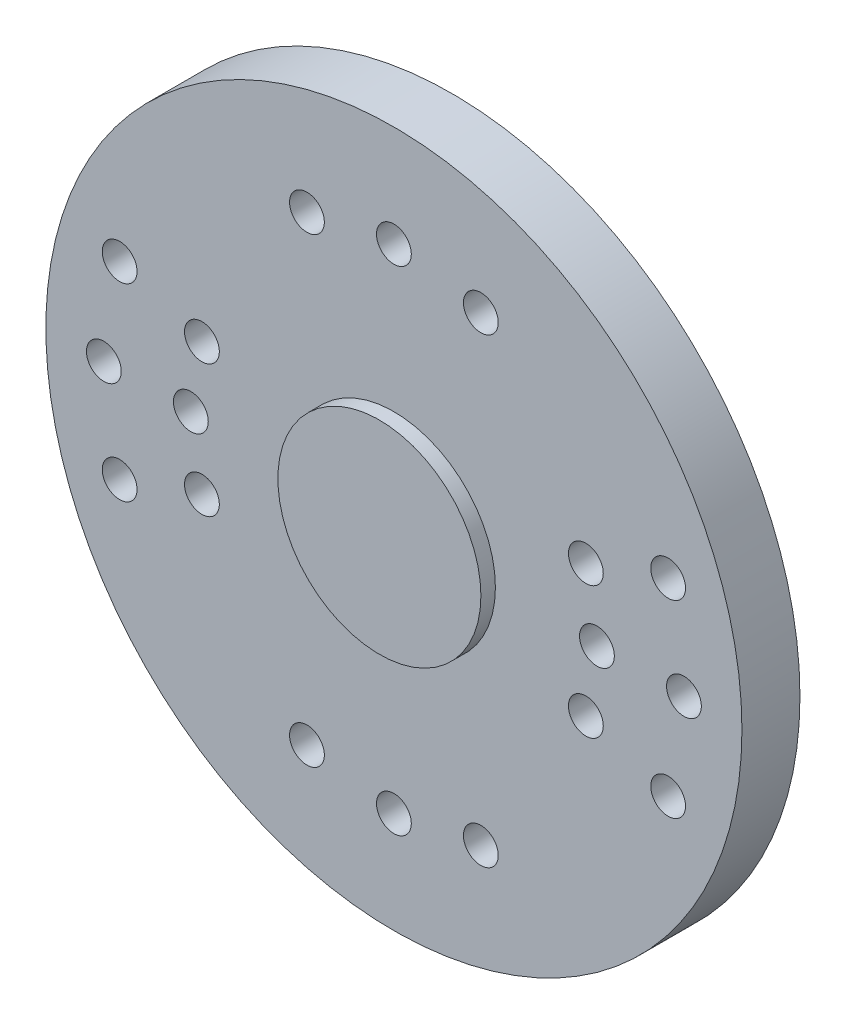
ISO-10303-21;
HEADER;
FILE_DESCRIPTION(('STEP AP214'),'2;1');
FILE_NAME('part.step','',(''),(''),'','','');
FILE_SCHEMA(('AUTOMOTIVE_DESIGN { 1 0 10303 214 1 1 1 1 }'));
ENDSEC;
DATA;
#1=APPLICATION_CONTEXT('core data for automotive mechanical design processes');
#2=APPLICATION_PROTOCOL_DEFINITION('international standard','automotive_design',2000,#1);
#3=PRODUCT_CONTEXT('',#1,'mechanical');
#4=PRODUCT('Part','Part','',(#3));
#5=PRODUCT_RELATED_PRODUCT_CATEGORY('part','',(#4));
#6=PRODUCT_DEFINITION_FORMATION('','',#4);
#7=PRODUCT_DEFINITION_CONTEXT('part definition',#1,'design');
#8=PRODUCT_DEFINITION('design','',#6,#7);
#9=PRODUCT_DEFINITION_SHAPE('','',#8);
#10=(LENGTH_UNIT() NAMED_UNIT(*) SI_UNIT(.MILLI.,.METRE.));
#11=(NAMED_UNIT(*) PLANE_ANGLE_UNIT() SI_UNIT($,.RADIAN.));
#12=(NAMED_UNIT(*) SI_UNIT($,.STERADIAN.) SOLID_ANGLE_UNIT());
#13=UNCERTAINTY_MEASURE_WITH_UNIT(LENGTH_MEASURE(1.E-05),#10,'distance_accuracy_value','');
#14=(GEOMETRIC_REPRESENTATION_CONTEXT(3) GLOBAL_UNCERTAINTY_ASSIGNED_CONTEXT((#13)) GLOBAL_UNIT_ASSIGNED_CONTEXT((#10,
#11,#12)) REPRESENTATION_CONTEXT('',''));
#15=CARTESIAN_POINT('',(0.,0.,0.));
#16=DIRECTION('',(0.,0.,1.));
#17=DIRECTION('',(1.,0.,0.));
#18=AXIS2_PLACEMENT_3D('',#15,#16,#17);
#19=CARTESIAN_POINT('',(0.,0.,0.));
#20=DIRECTION('',(0.,0.,1.));
#21=DIRECTION('',(1.,0.,0.));
#22=AXIS2_PLACEMENT_3D('',#19,#20,#21);
#23=PLANE('',#22);
#24=CARTESIAN_POINT('',(9.45518575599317,3.25568154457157,0.));
#25=DIRECTION('',(0.,0.,1.));
#26=DIRECTION('',(1.,0.,0.));
#27=AXIS2_PLACEMENT_3D('',#24,#25,#26);
#28=CIRCLE('',#27,0.6);
#29=CARTESIAN_POINT('',(10.0551857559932,3.25568154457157,0.));
#30=VERTEX_POINT('',#29);
#31=EDGE_CURVE('E160',#30,#30,#28,.T.);
#32=ORIENTED_EDGE('',*,*,#31,.T.);
#33=EDGE_LOOP('',(#32));
#34=FACE_BOUND('',#33,.T.);
#35=CARTESIAN_POINT('',(10.,0.,0.));
#36=DIRECTION('',(0.,0.,1.));
#37=DIRECTION('',(1.,0.,0.));
#38=AXIS2_PLACEMENT_3D('',#35,#36,#37);
#39=CIRCLE('',#38,0.6);
#40=CARTESIAN_POINT('',(10.6,0.,0.));
#41=VERTEX_POINT('',#40);
#42=EDGE_CURVE('E154',#41,#41,#39,.T.);
#43=ORIENTED_EDGE('',*,*,#42,.T.);
#44=EDGE_LOOP('',(#43));
#45=FACE_BOUND('',#44,.T.);
#46=CARTESIAN_POINT('',(9.45518575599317,-3.25568154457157,0.));
#47=DIRECTION('',(0.,0.,1.));
#48=DIRECTION('',(1.,0.,0.));
#49=AXIS2_PLACEMENT_3D('',#46,#47,#48);
#50=CIRCLE('',#49,0.6);
#51=CARTESIAN_POINT('',(10.0551857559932,-3.25568154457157,0.));
#52=VERTEX_POINT('',#51);
#53=EDGE_CURVE('E148',#52,#52,#50,.T.);
#54=ORIENTED_EDGE('',*,*,#53,.T.);
#55=EDGE_LOOP('',(#54));
#56=FACE_BOUND('',#55,.T.);
#57=CARTESIAN_POINT('',(6.61863002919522,-2.2789770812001,0.));
#58=DIRECTION('',(0.,0.,1.));
#59=DIRECTION('',(1.,0.,0.));
#60=AXIS2_PLACEMENT_3D('',#57,#58,#59);
#61=CIRCLE('',#60,0.6);
#62=CARTESIAN_POINT('',(7.21863002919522,-2.2789770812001,0.));
#63=VERTEX_POINT('',#62);
#64=EDGE_CURVE('E142',#63,#63,#61,.T.);
#65=ORIENTED_EDGE('',*,*,#64,.T.);
#66=EDGE_LOOP('',(#65));
#67=FACE_BOUND('',#66,.T.);
#68=CARTESIAN_POINT('',(7.,0.,0.));
#69=DIRECTION('',(0.,0.,1.));
#70=DIRECTION('',(1.,0.,0.));
#71=AXIS2_PLACEMENT_3D('',#68,#69,#70);
#72=CIRCLE('',#71,0.6);
#73=CARTESIAN_POINT('',(7.6,0.,0.));
#74=VERTEX_POINT('',#73);
#75=EDGE_CURVE('E136',#74,#74,#72,.T.);
#76=ORIENTED_EDGE('',*,*,#75,.T.);
#77=EDGE_LOOP('',(#76));
#78=FACE_BOUND('',#77,.T.);
#79=CARTESIAN_POINT('',(6.61863002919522,2.2789770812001,0.));
#80=DIRECTION('',(0.,0.,1.));
#81=DIRECTION('',(1.,0.,0.));
#82=AXIS2_PLACEMENT_3D('',#79,#80,#81);
#83=CIRCLE('',#82,0.6);
#84=CARTESIAN_POINT('',(7.21863002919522,2.2789770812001,0.));
#85=VERTEX_POINT('',#84);
#86=EDGE_CURVE('E130',#85,#85,#83,.T.);
#87=ORIENTED_EDGE('',*,*,#86,.T.);
#88=EDGE_LOOP('',(#87));
#89=FACE_BOUND('',#88,.T.);
#90=CARTESIAN_POINT('',(-9.45518575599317,3.25568154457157,0.));
#91=DIRECTION('',(0.,0.,1.));
#92=DIRECTION('',(1.,0.,0.));
#93=AXIS2_PLACEMENT_3D('',#90,#91,#92);
#94=CIRCLE('',#93,0.6);
#95=CARTESIAN_POINT('',(-8.85518575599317,3.25568154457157,0.));
#96=VERTEX_POINT('',#95);
#97=EDGE_CURVE('E124',#96,#96,#94,.T.);
#98=ORIENTED_EDGE('',*,*,#97,.T.);
#99=EDGE_LOOP('',(#98));
#100=FACE_BOUND('',#99,.T.);
#101=CARTESIAN_POINT('',(-10.,0.,0.));
#102=DIRECTION('',(0.,0.,1.));
#103=DIRECTION('',(1.,0.,0.));
#104=AXIS2_PLACEMENT_3D('',#101,#102,#103);
#105=CIRCLE('',#104,0.6);
#106=CARTESIAN_POINT('',(-9.4,0.,0.));
#107=VERTEX_POINT('',#106);
#108=EDGE_CURVE('E118',#107,#107,#105,.T.);
#109=ORIENTED_EDGE('',*,*,#108,.T.);
#110=EDGE_LOOP('',(#109));
#111=FACE_BOUND('',#110,.T.);
#112=CARTESIAN_POINT('',(-9.45518575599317,-3.25568154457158,0.));
#113=DIRECTION('',(0.,0.,1.));
#114=DIRECTION('',(1.,0.,0.));
#115=AXIS2_PLACEMENT_3D('',#112,#113,#114);
#116=CIRCLE('',#115,0.6);
#117=CARTESIAN_POINT('',(-8.85518575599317,-3.25568154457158,0.));
#118=VERTEX_POINT('',#117);
#119=EDGE_CURVE('E112',#118,#118,#116,.T.);
#120=ORIENTED_EDGE('',*,*,#119,.T.);
#121=EDGE_LOOP('',(#120));
#122=FACE_BOUND('',#121,.T.);
#123=CARTESIAN_POINT('',(-6.61863002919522,-2.2789770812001,0.));
#124=DIRECTION('',(0.,0.,1.));
#125=DIRECTION('',(1.,0.,0.));
#126=AXIS2_PLACEMENT_3D('',#123,#124,#125);
#127=CIRCLE('',#126,0.6);
#128=CARTESIAN_POINT('',(-6.01863002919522,-2.2789770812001,0.));
#129=VERTEX_POINT('',#128);
#130=EDGE_CURVE('E106',#129,#129,#127,.T.);
#131=ORIENTED_EDGE('',*,*,#130,.T.);
#132=EDGE_LOOP('',(#131));
#133=FACE_BOUND('',#132,.T.);
#134=CARTESIAN_POINT('',(-7.,0.,0.));
#135=DIRECTION('',(0.,0.,1.));
#136=DIRECTION('',(1.,0.,0.));
#137=AXIS2_PLACEMENT_3D('',#134,#135,#136);
#138=CIRCLE('',#137,0.6);
#139=CARTESIAN_POINT('',(-6.4,0.,0.));
#140=VERTEX_POINT('',#139);
#141=EDGE_CURVE('E100',#140,#140,#138,.T.);
#142=ORIENTED_EDGE('',*,*,#141,.T.);
#143=EDGE_LOOP('',(#142));
#144=FACE_BOUND('',#143,.T.);
#145=CARTESIAN_POINT('',(-6.61863002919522,2.2789770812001,0.));
#146=DIRECTION('',(0.,0.,1.));
#147=DIRECTION('',(1.,0.,0.));
#148=AXIS2_PLACEMENT_3D('',#145,#146,#147);
#149=CIRCLE('',#148,0.6);
#150=CARTESIAN_POINT('',(-6.01863002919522,2.2789770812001,0.));
#151=VERTEX_POINT('',#150);
#152=EDGE_CURVE('E94',#151,#151,#149,.T.);
#153=ORIENTED_EDGE('',*,*,#152,.T.);
#154=EDGE_LOOP('',(#153));
#155=FACE_BOUND('',#154,.T.);
#156=CARTESIAN_POINT('',(2.9975962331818,-7.95389318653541,0.));
#157=DIRECTION('',(0.,0.,1.));
#158=DIRECTION('',(1.,0.,0.));
#159=AXIS2_PLACEMENT_3D('',#156,#157,#158);
#160=CIRCLE('',#159,0.6);
#161=CARTESIAN_POINT('',(3.5975962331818,-7.95389318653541,0.));
#162=VERTEX_POINT('',#161);
#163=EDGE_CURVE('E88',#162,#162,#160,.T.);
#164=ORIENTED_EDGE('',*,*,#163,.T.);
#165=EDGE_LOOP('',(#164));
#166=FACE_BOUND('',#165,.T.);
#167=CARTESIAN_POINT('',(0.,-8.5,0.));
#168=DIRECTION('',(0.,0.,1.));
#169=DIRECTION('',(1.,0.,0.));
#170=AXIS2_PLACEMENT_3D('',#167,#168,#169);
#171=CIRCLE('',#170,0.6);
#172=CARTESIAN_POINT('',(0.600000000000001,-8.5,0.));
#173=VERTEX_POINT('',#172);
#174=EDGE_CURVE('E82',#173,#173,#171,.T.);
#175=ORIENTED_EDGE('',*,*,#174,.T.);
#176=EDGE_LOOP('',(#175));
#177=FACE_BOUND('',#176,.T.);
#178=CARTESIAN_POINT('',(-2.9975962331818,-7.95389318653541,0.));
#179=DIRECTION('',(0.,0.,1.));
#180=DIRECTION('',(1.,0.,0.));
#181=AXIS2_PLACEMENT_3D('',#178,#179,#180);
#182=CIRCLE('',#181,0.6);
#183=CARTESIAN_POINT('',(-2.3975962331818,-7.95389318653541,0.));
#184=VERTEX_POINT('',#183);
#185=EDGE_CURVE('E76',#184,#184,#182,.T.);
#186=ORIENTED_EDGE('',*,*,#185,.T.);
#187=EDGE_LOOP('',(#186));
#188=FACE_BOUND('',#187,.T.);
#189=CARTESIAN_POINT('',(2.9975962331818,7.95389318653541,0.));
#190=DIRECTION('',(0.,0.,1.));
#191=DIRECTION('',(1.,0.,0.));
#192=AXIS2_PLACEMENT_3D('',#189,#190,#191);
#193=CIRCLE('',#192,0.6);
#194=CARTESIAN_POINT('',(3.5975962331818,7.95389318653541,0.));
#195=VERTEX_POINT('',#194);
#196=EDGE_CURVE('E70',#195,#195,#193,.T.);
#197=ORIENTED_EDGE('',*,*,#196,.T.);
#198=EDGE_LOOP('',(#197));
#199=FACE_BOUND('',#198,.T.);
#200=CARTESIAN_POINT('',(0.,8.5,0.));
#201=DIRECTION('',(0.,0.,1.));
#202=DIRECTION('',(1.,0.,0.));
#203=AXIS2_PLACEMENT_3D('',#200,#201,#202);
#204=CIRCLE('',#203,0.6);
#205=CARTESIAN_POINT('',(0.600000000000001,8.5,0.));
#206=VERTEX_POINT('',#205);
#207=EDGE_CURVE('E64',#206,#206,#204,.T.);
#208=ORIENTED_EDGE('',*,*,#207,.T.);
#209=EDGE_LOOP('',(#208));
#210=FACE_BOUND('',#209,.T.);
#211=CARTESIAN_POINT('',(-2.9975962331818,7.9538931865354,0.));
#212=DIRECTION('',(0.,0.,1.));
#213=DIRECTION('',(1.,0.,0.));
#214=AXIS2_PLACEMENT_3D('',#211,#212,#213);
#215=CIRCLE('',#214,0.6);
#216=CARTESIAN_POINT('',(-2.3975962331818,7.9538931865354,0.));
#217=VERTEX_POINT('',#216);
#218=EDGE_CURVE('E58',#217,#217,#215,.T.);
#219=ORIENTED_EDGE('',*,*,#218,.T.);
#220=EDGE_LOOP('',(#219));
#221=FACE_BOUND('',#220,.T.);
#222=CARTESIAN_POINT('',(0.,0.,0.));
#223=DIRECTION('',(0.,0.,1.));
#224=DIRECTION('',(1.,0.,0.));
#225=AXIS2_PLACEMENT_3D('',#222,#223,#224);
#226=CIRCLE('',#225,12.);
#227=CARTESIAN_POINT('',(12.,0.,0.));
#228=VERTEX_POINT('',#227);
#229=EDGE_CURVE('E43',#228,#228,#226,.T.);
#230=ORIENTED_EDGE('',*,*,#229,.F.);
#231=EDGE_LOOP('',(#230));
#232=FACE_BOUND('',#231,.T.);
#233=CARTESIAN_POINT('',(0.,0.,0.));
#234=DIRECTION('',(0.,0.,1.));
#235=DIRECTION('',(1.,0.,0.));
#236=AXIS2_PLACEMENT_3D('',#233,#234,#235);
#237=CIRCLE('',#236,4.5);
#238=CARTESIAN_POINT('',(4.5,0.,0.));
#239=VERTEX_POINT('',#238);
#240=EDGE_CURVE('E10',#239,#239,#237,.F.);
#241=ORIENTED_EDGE('',*,*,#240,.F.);
#242=EDGE_LOOP('',(#241));
#243=FACE_BOUND('',#242,.T.);
#244=ADVANCED_FACE('F32',(#34,#45,#56,#67,#78,#89,#100,#111,#122,#133,#144,#155,#166,#177,#188,
#199,#210,#221,#232,#243),#23,.F.);
#245=CARTESIAN_POINT('',(0.,0.,2.));
#246=DIRECTION('',(0.,0.,1.));
#247=DIRECTION('',(1.,0.,0.));
#248=AXIS2_PLACEMENT_3D('',#245,#246,#247);
#249=PLANE('',#248);
#250=CARTESIAN_POINT('',(9.45518575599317,3.25568154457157,2.));
#251=DIRECTION('',(0.,0.,1.));
#252=DIRECTION('',(1.,0.,0.));
#253=AXIS2_PLACEMENT_3D('',#250,#251,#252);
#254=CIRCLE('',#253,0.6);
#255=CARTESIAN_POINT('',(10.0551857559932,3.25568154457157,2.));
#256=VERTEX_POINT('',#255);
#257=EDGE_CURVE('E163',#256,#256,#254,.T.);
#258=ORIENTED_EDGE('',*,*,#257,.F.);
#259=EDGE_LOOP('',(#258));
#260=FACE_BOUND('',#259,.T.);
#261=CARTESIAN_POINT('',(10.,0.,2.));
#262=DIRECTION('',(0.,0.,1.));
#263=DIRECTION('',(1.,0.,0.));
#264=AXIS2_PLACEMENT_3D('',#261,#262,#263);
#265=CIRCLE('',#264,0.6);
#266=CARTESIAN_POINT('',(10.6,0.,2.));
#267=VERTEX_POINT('',#266);
#268=EDGE_CURVE('E157',#267,#267,#265,.T.);
#269=ORIENTED_EDGE('',*,*,#268,.F.);
#270=EDGE_LOOP('',(#269));
#271=FACE_BOUND('',#270,.T.);
#272=CARTESIAN_POINT('',(9.45518575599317,-3.25568154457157,2.));
#273=DIRECTION('',(0.,0.,1.));
#274=DIRECTION('',(1.,0.,0.));
#275=AXIS2_PLACEMENT_3D('',#272,#273,#274);
#276=CIRCLE('',#275,0.6);
#277=CARTESIAN_POINT('',(10.0551857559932,-3.25568154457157,2.));
#278=VERTEX_POINT('',#277);
#279=EDGE_CURVE('E151',#278,#278,#276,.T.);
#280=ORIENTED_EDGE('',*,*,#279,.F.);
#281=EDGE_LOOP('',(#280));
#282=FACE_BOUND('',#281,.T.);
#283=CARTESIAN_POINT('',(6.61863002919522,-2.2789770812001,2.));
#284=DIRECTION('',(0.,0.,1.));
#285=DIRECTION('',(1.,0.,0.));
#286=AXIS2_PLACEMENT_3D('',#283,#284,#285);
#287=CIRCLE('',#286,0.6);
#288=CARTESIAN_POINT('',(7.21863002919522,-2.2789770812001,2.));
#289=VERTEX_POINT('',#288);
#290=EDGE_CURVE('E145',#289,#289,#287,.T.);
#291=ORIENTED_EDGE('',*,*,#290,.F.);
#292=EDGE_LOOP('',(#291));
#293=FACE_BOUND('',#292,.T.);
#294=CARTESIAN_POINT('',(7.,0.,2.));
#295=DIRECTION('',(0.,0.,1.));
#296=DIRECTION('',(1.,0.,0.));
#297=AXIS2_PLACEMENT_3D('',#294,#295,#296);
#298=CIRCLE('',#297,0.6);
#299=CARTESIAN_POINT('',(7.6,0.,2.));
#300=VERTEX_POINT('',#299);
#301=EDGE_CURVE('E139',#300,#300,#298,.T.);
#302=ORIENTED_EDGE('',*,*,#301,.F.);
#303=EDGE_LOOP('',(#302));
#304=FACE_BOUND('',#303,.T.);
#305=CARTESIAN_POINT('',(6.61863002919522,2.2789770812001,2.));
#306=DIRECTION('',(0.,0.,1.));
#307=DIRECTION('',(1.,0.,0.));
#308=AXIS2_PLACEMENT_3D('',#305,#306,#307);
#309=CIRCLE('',#308,0.6);
#310=CARTESIAN_POINT('',(7.21863002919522,2.2789770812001,2.));
#311=VERTEX_POINT('',#310);
#312=EDGE_CURVE('E133',#311,#311,#309,.T.);
#313=ORIENTED_EDGE('',*,*,#312,.F.);
#314=EDGE_LOOP('',(#313));
#315=FACE_BOUND('',#314,.T.);
#316=CARTESIAN_POINT('',(-9.45518575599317,3.25568154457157,2.));
#317=DIRECTION('',(0.,0.,1.));
#318=DIRECTION('',(1.,0.,0.));
#319=AXIS2_PLACEMENT_3D('',#316,#317,#318);
#320=CIRCLE('',#319,0.6);
#321=CARTESIAN_POINT('',(-8.85518575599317,3.25568154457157,2.));
#322=VERTEX_POINT('',#321);
#323=EDGE_CURVE('E127',#322,#322,#320,.T.);
#324=ORIENTED_EDGE('',*,*,#323,.F.);
#325=EDGE_LOOP('',(#324));
#326=FACE_BOUND('',#325,.T.);
#327=CARTESIAN_POINT('',(-10.,0.,2.));
#328=DIRECTION('',(0.,0.,1.));
#329=DIRECTION('',(1.,0.,0.));
#330=AXIS2_PLACEMENT_3D('',#327,#328,#329);
#331=CIRCLE('',#330,0.6);
#332=CARTESIAN_POINT('',(-9.4,0.,2.));
#333=VERTEX_POINT('',#332);
#334=EDGE_CURVE('E121',#333,#333,#331,.T.);
#335=ORIENTED_EDGE('',*,*,#334,.F.);
#336=EDGE_LOOP('',(#335));
#337=FACE_BOUND('',#336,.T.);
#338=CARTESIAN_POINT('',(-9.45518575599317,-3.25568154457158,2.));
#339=DIRECTION('',(0.,0.,1.));
#340=DIRECTION('',(1.,0.,0.));
#341=AXIS2_PLACEMENT_3D('',#338,#339,#340);
#342=CIRCLE('',#341,0.6);
#343=CARTESIAN_POINT('',(-8.85518575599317,-3.25568154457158,2.));
#344=VERTEX_POINT('',#343);
#345=EDGE_CURVE('E115',#344,#344,#342,.T.);
#346=ORIENTED_EDGE('',*,*,#345,.F.);
#347=EDGE_LOOP('',(#346));
#348=FACE_BOUND('',#347,.T.);
#349=CARTESIAN_POINT('',(-6.61863002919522,-2.2789770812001,2.));
#350=DIRECTION('',(0.,0.,1.));
#351=DIRECTION('',(1.,0.,0.));
#352=AXIS2_PLACEMENT_3D('',#349,#350,#351);
#353=CIRCLE('',#352,0.6);
#354=CARTESIAN_POINT('',(-6.01863002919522,-2.2789770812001,2.));
#355=VERTEX_POINT('',#354);
#356=EDGE_CURVE('E109',#355,#355,#353,.T.);
#357=ORIENTED_EDGE('',*,*,#356,.F.);
#358=EDGE_LOOP('',(#357));
#359=FACE_BOUND('',#358,.T.);
#360=CARTESIAN_POINT('',(-7.,0.,2.));
#361=DIRECTION('',(0.,0.,1.));
#362=DIRECTION('',(1.,0.,0.));
#363=AXIS2_PLACEMENT_3D('',#360,#361,#362);
#364=CIRCLE('',#363,0.6);
#365=CARTESIAN_POINT('',(-6.4,0.,2.));
#366=VERTEX_POINT('',#365);
#367=EDGE_CURVE('E103',#366,#366,#364,.T.);
#368=ORIENTED_EDGE('',*,*,#367,.F.);
#369=EDGE_LOOP('',(#368));
#370=FACE_BOUND('',#369,.T.);
#371=CARTESIAN_POINT('',(-6.61863002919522,2.2789770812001,2.));
#372=DIRECTION('',(0.,0.,1.));
#373=DIRECTION('',(1.,0.,0.));
#374=AXIS2_PLACEMENT_3D('',#371,#372,#373);
#375=CIRCLE('',#374,0.6);
#376=CARTESIAN_POINT('',(-6.01863002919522,2.2789770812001,2.));
#377=VERTEX_POINT('',#376);
#378=EDGE_CURVE('E97',#377,#377,#375,.T.);
#379=ORIENTED_EDGE('',*,*,#378,.F.);
#380=EDGE_LOOP('',(#379));
#381=FACE_BOUND('',#380,.T.);
#382=CARTESIAN_POINT('',(2.9975962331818,-7.95389318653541,2.));
#383=DIRECTION('',(0.,0.,1.));
#384=DIRECTION('',(1.,0.,0.));
#385=AXIS2_PLACEMENT_3D('',#382,#383,#384);
#386=CIRCLE('',#385,0.6);
#387=CARTESIAN_POINT('',(3.5975962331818,-7.95389318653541,2.));
#388=VERTEX_POINT('',#387);
#389=EDGE_CURVE('E91',#388,#388,#386,.T.);
#390=ORIENTED_EDGE('',*,*,#389,.F.);
#391=EDGE_LOOP('',(#390));
#392=FACE_BOUND('',#391,.T.);
#393=CARTESIAN_POINT('',(0.,-8.5,2.));
#394=DIRECTION('',(0.,0.,1.));
#395=DIRECTION('',(1.,0.,0.));
#396=AXIS2_PLACEMENT_3D('',#393,#394,#395);
#397=CIRCLE('',#396,0.6);
#398=CARTESIAN_POINT('',(0.600000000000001,-8.5,2.));
#399=VERTEX_POINT('',#398);
#400=EDGE_CURVE('E85',#399,#399,#397,.T.);
#401=ORIENTED_EDGE('',*,*,#400,.F.);
#402=EDGE_LOOP('',(#401));
#403=FACE_BOUND('',#402,.T.);
#404=CARTESIAN_POINT('',(-2.9975962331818,-7.95389318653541,2.));
#405=DIRECTION('',(0.,0.,1.));
#406=DIRECTION('',(1.,0.,0.));
#407=AXIS2_PLACEMENT_3D('',#404,#405,#406);
#408=CIRCLE('',#407,0.6);
#409=CARTESIAN_POINT('',(-2.3975962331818,-7.95389318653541,2.));
#410=VERTEX_POINT('',#409);
#411=EDGE_CURVE('E79',#410,#410,#408,.T.);
#412=ORIENTED_EDGE('',*,*,#411,.F.);
#413=EDGE_LOOP('',(#412));
#414=FACE_BOUND('',#413,.T.);
#415=CARTESIAN_POINT('',(2.9975962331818,7.95389318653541,2.));
#416=DIRECTION('',(0.,0.,1.));
#417=DIRECTION('',(1.,0.,0.));
#418=AXIS2_PLACEMENT_3D('',#415,#416,#417);
#419=CIRCLE('',#418,0.6);
#420=CARTESIAN_POINT('',(3.5975962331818,7.95389318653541,2.));
#421=VERTEX_POINT('',#420);
#422=EDGE_CURVE('E73',#421,#421,#419,.T.);
#423=ORIENTED_EDGE('',*,*,#422,.F.);
#424=EDGE_LOOP('',(#423));
#425=FACE_BOUND('',#424,.T.);
#426=CARTESIAN_POINT('',(0.,8.5,2.));
#427=DIRECTION('',(0.,0.,1.));
#428=DIRECTION('',(1.,0.,0.));
#429=AXIS2_PLACEMENT_3D('',#426,#427,#428);
#430=CIRCLE('',#429,0.6);
#431=CARTESIAN_POINT('',(0.600000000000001,8.5,2.));
#432=VERTEX_POINT('',#431);
#433=EDGE_CURVE('E67',#432,#432,#430,.T.);
#434=ORIENTED_EDGE('',*,*,#433,.F.);
#435=EDGE_LOOP('',(#434));
#436=FACE_BOUND('',#435,.T.);
#437=CARTESIAN_POINT('',(-2.9975962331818,7.9538931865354,2.));
#438=DIRECTION('',(0.,0.,1.));
#439=DIRECTION('',(1.,0.,0.));
#440=AXIS2_PLACEMENT_3D('',#437,#438,#439);
#441=CIRCLE('',#440,0.6);
#442=CARTESIAN_POINT('',(-2.3975962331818,7.9538931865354,2.));
#443=VERTEX_POINT('',#442);
#444=EDGE_CURVE('E61',#443,#443,#441,.T.);
#445=ORIENTED_EDGE('',*,*,#444,.F.);
#446=EDGE_LOOP('',(#445));
#447=FACE_BOUND('',#446,.T.);
#448=CARTESIAN_POINT('',(0.,0.,2.));
#449=DIRECTION('',(0.,0.,1.));
#450=DIRECTION('',(1.,0.,0.));
#451=AXIS2_PLACEMENT_3D('',#448,#449,#450);
#452=CIRCLE('',#451,12.);
#453=CARTESIAN_POINT('',(12.,0.,2.));
#454=VERTEX_POINT('',#453);
#455=EDGE_CURVE('E39',#454,#454,#452,.T.);
#456=ORIENTED_EDGE('',*,*,#455,.T.);
#457=EDGE_LOOP('',(#456));
#458=FACE_BOUND('',#457,.T.);
#459=CARTESIAN_POINT('',(0.,0.,2.));
#460=DIRECTION('',(0.,0.,1.));
#461=DIRECTION('',(1.,0.,0.));
#462=AXIS2_PLACEMENT_3D('',#459,#460,#461);
#463=CIRCLE('',#462,3.5);
#464=CARTESIAN_POINT('',(3.5,0.,2.));
#465=VERTEX_POINT('',#464);
#466=EDGE_CURVE('E50',#465,#465,#463,.T.);
#467=ORIENTED_EDGE('',*,*,#466,.F.);
#468=EDGE_LOOP('',(#467));
#469=FACE_BOUND('',#468,.T.);
#470=ADVANCED_FACE('F200',(#260,#271,#282,#293,#304,#315,#326,#337,#348,#359,#370,#381,#392,
#403,#414,#425,#436,#447,#458,#469),#249,.T.);
#471=CARTESIAN_POINT('',(0.,0.,2.));
#472=DIRECTION('',(0.,0.,-1.));
#473=DIRECTION('',(-1.,0.,0.));
#474=AXIS2_PLACEMENT_3D('',#471,#472,#473);
#475=CYLINDRICAL_SURFACE('',#474,12.);
#476=ORIENTED_EDGE('',*,*,#455,.F.);
#477=EDGE_LOOP('',(#476));
#478=FACE_BOUND('',#477,.T.);
#479=ORIENTED_EDGE('',*,*,#229,.T.);
#480=EDGE_LOOP('',(#479));
#481=FACE_BOUND('',#480,.T.);
#482=ADVANCED_FACE('F34',(#478,#481),#475,.T.);
#483=CARTESIAN_POINT('',(0.,0.,2.5));
#484=DIRECTION('',(0.,0.,-1.));
#485=DIRECTION('',(-1.,0.,0.));
#486=AXIS2_PLACEMENT_3D('',#483,#484,#485);
#487=CYLINDRICAL_SURFACE('',#486,3.5);
#488=CARTESIAN_POINT('',(0.,0.,2.5));
#489=DIRECTION('',(0.,0.,1.));
#490=DIRECTION('',(1.,0.,0.));
#491=AXIS2_PLACEMENT_3D('',#488,#489,#490);
#492=CIRCLE('',#491,3.5);
#493=CARTESIAN_POINT('',(3.5,0.,2.5));
#494=VERTEX_POINT('',#493);
#495=EDGE_CURVE('E48',#494,#494,#492,.T.);
#496=ORIENTED_EDGE('',*,*,#495,.F.);
#497=EDGE_LOOP('',(#496));
#498=FACE_BOUND('',#497,.T.);
#499=ORIENTED_EDGE('',*,*,#466,.T.);
#500=EDGE_LOOP('',(#499));
#501=FACE_BOUND('',#500,.T.);
#502=ADVANCED_FACE('F196',(#498,#501),#487,.T.);
#503=CARTESIAN_POINT('',(0.,0.,2.5));
#504=DIRECTION('',(0.,0.,1.));
#505=DIRECTION('',(1.,0.,0.));
#506=AXIS2_PLACEMENT_3D('',#503,#504,#505);
#507=PLANE('',#506);
#508=ORIENTED_EDGE('',*,*,#495,.T.);
#509=EDGE_LOOP('',(#508));
#510=FACE_BOUND('',#509,.T.);
#511=ADVANCED_FACE('F191',(#510),#507,.T.);
#512=CARTESIAN_POINT('',(0.,0.,-2.));
#513=DIRECTION('',(0.,0.,1.));
#514=DIRECTION('',(1.,0.,0.));
#515=AXIS2_PLACEMENT_3D('',#512,#513,#514);
#516=CYLINDRICAL_SURFACE('',#515,4.5);
#517=CARTESIAN_POINT('',(0.,0.,-2.));
#518=DIRECTION('',(0.,0.,-1.));
#519=DIRECTION('',(-1.,0.,0.));
#520=AXIS2_PLACEMENT_3D('',#517,#518,#519);
#521=CIRCLE('',#520,4.5);
#522=CARTESIAN_POINT('',(-4.5,0.,-2.));
#523=VERTEX_POINT('',#522);
#524=EDGE_CURVE('E53',#523,#523,#521,.T.);
#525=ORIENTED_EDGE('',*,*,#524,.F.);
#526=EDGE_LOOP('',(#525));
#527=FACE_BOUND('',#526,.T.);
#528=ORIENTED_EDGE('',*,*,#240,.T.);
#529=EDGE_LOOP('',(#528));
#530=FACE_BOUND('',#529,.T.);
#531=ADVANCED_FACE('F186',(#527,#530),#516,.T.);
#532=CARTESIAN_POINT('',(0.,0.,-2.));
#533=DIRECTION('',(0.,0.,-1.));
#534=DIRECTION('',(-1.,0.,0.));
#535=AXIS2_PLACEMENT_3D('',#532,#533,#534);
#536=PLANE('',#535);
#537=CARTESIAN_POINT('',(0.,0.,-2.));
#538=DIRECTION('',(0.,0.,-1.));
#539=DIRECTION('',(-1.,0.,0.));
#540=AXIS2_PLACEMENT_3D('',#537,#538,#539);
#541=CIRCLE('',#540,2.9);
#542=CARTESIAN_POINT('',(-2.9,0.,-2.));
#543=VERTEX_POINT('',#542);
#544=EDGE_CURVE('E167',#543,#543,#541,.T.);
#545=ORIENTED_EDGE('',*,*,#544,.F.);
#546=EDGE_LOOP('',(#545));
#547=FACE_BOUND('',#546,.T.);
#548=ORIENTED_EDGE('',*,*,#524,.T.);
#549=EDGE_LOOP('',(#548));
#550=FACE_BOUND('',#549,.T.);
#551=ADVANCED_FACE('F182',(#547,#550),#536,.T.);
#552=CARTESIAN_POINT('',(-2.9975962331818,7.9538931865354,-2.));
#553=DIRECTION('',(0.,0.,1.));
#554=DIRECTION('',(1.,0.,0.));
#555=AXIS2_PLACEMENT_3D('',#552,#553,#554);
#556=CYLINDRICAL_SURFACE('',#555,0.6);
#557=ORIENTED_EDGE('',*,*,#444,.T.);
#558=EDGE_LOOP('',(#557));
#559=FACE_BOUND('',#558,.T.);
#560=ORIENTED_EDGE('',*,*,#218,.F.);
#561=EDGE_LOOP('',(#560));
#562=FACE_BOUND('',#561,.T.);
#563=ADVANCED_FACE('F185',(#559,#562),#556,.F.);
#564=CARTESIAN_POINT('',(0.,8.5,-2.));
#565=DIRECTION('',(0.,0.,1.));
#566=DIRECTION('',(1.,0.,0.));
#567=AXIS2_PLACEMENT_3D('',#564,#565,#566);
#568=CYLINDRICAL_SURFACE('',#567,0.6);
#569=ORIENTED_EDGE('',*,*,#433,.T.);
#570=EDGE_LOOP('',(#569));
#571=FACE_BOUND('',#570,.T.);
#572=ORIENTED_EDGE('',*,*,#207,.F.);
#573=EDGE_LOOP('',(#572));
#574=FACE_BOUND('',#573,.T.);
#575=ADVANCED_FACE('F241',(#571,#574),#568,.F.);
#576=CARTESIAN_POINT('',(2.9975962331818,7.95389318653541,-2.));
#577=DIRECTION('',(0.,0.,1.));
#578=DIRECTION('',(1.,0.,0.));
#579=AXIS2_PLACEMENT_3D('',#576,#577,#578);
#580=CYLINDRICAL_SURFACE('',#579,0.6);
#581=ORIENTED_EDGE('',*,*,#422,.T.);
#582=EDGE_LOOP('',(#581));
#583=FACE_BOUND('',#582,.T.);
#584=ORIENTED_EDGE('',*,*,#196,.F.);
#585=EDGE_LOOP('',(#584));
#586=FACE_BOUND('',#585,.T.);
#587=ADVANCED_FACE('F252',(#583,#586),#580,.F.);
#588=CARTESIAN_POINT('',(-2.9975962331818,-7.95389318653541,-2.));
#589=DIRECTION('',(0.,0.,1.));
#590=DIRECTION('',(1.,0.,0.));
#591=AXIS2_PLACEMENT_3D('',#588,#589,#590);
#592=CYLINDRICAL_SURFACE('',#591,0.6);
#593=ORIENTED_EDGE('',*,*,#411,.T.);
#594=EDGE_LOOP('',(#593));
#595=FACE_BOUND('',#594,.T.);
#596=ORIENTED_EDGE('',*,*,#185,.F.);
#597=EDGE_LOOP('',(#596));
#598=FACE_BOUND('',#597,.T.);
#599=ADVANCED_FACE('F262',(#595,#598),#592,.F.);
#600=CARTESIAN_POINT('',(0.,-8.5,-2.));
#601=DIRECTION('',(0.,0.,1.));
#602=DIRECTION('',(1.,0.,0.));
#603=AXIS2_PLACEMENT_3D('',#600,#601,#602);
#604=CYLINDRICAL_SURFACE('',#603,0.6);
#605=ORIENTED_EDGE('',*,*,#400,.T.);
#606=EDGE_LOOP('',(#605));
#607=FACE_BOUND('',#606,.T.);
#608=ORIENTED_EDGE('',*,*,#174,.F.);
#609=EDGE_LOOP('',(#608));
#610=FACE_BOUND('',#609,.T.);
#611=ADVANCED_FACE('F272',(#607,#610),#604,.F.);
#612=CARTESIAN_POINT('',(2.9975962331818,-7.95389318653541,-2.));
#613=DIRECTION('',(0.,0.,1.));
#614=DIRECTION('',(1.,0.,0.));
#615=AXIS2_PLACEMENT_3D('',#612,#613,#614);
#616=CYLINDRICAL_SURFACE('',#615,0.6);
#617=ORIENTED_EDGE('',*,*,#389,.T.);
#618=EDGE_LOOP('',(#617));
#619=FACE_BOUND('',#618,.T.);
#620=ORIENTED_EDGE('',*,*,#163,.F.);
#621=EDGE_LOOP('',(#620));
#622=FACE_BOUND('',#621,.T.);
#623=ADVANCED_FACE('F282',(#619,#622),#616,.F.);
#624=CARTESIAN_POINT('',(-6.61863002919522,2.2789770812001,-2.));
#625=DIRECTION('',(0.,0.,1.));
#626=DIRECTION('',(1.,0.,0.));
#627=AXIS2_PLACEMENT_3D('',#624,#625,#626);
#628=CYLINDRICAL_SURFACE('',#627,0.6);
#629=ORIENTED_EDGE('',*,*,#378,.T.);
#630=EDGE_LOOP('',(#629));
#631=FACE_BOUND('',#630,.T.);
#632=ORIENTED_EDGE('',*,*,#152,.F.);
#633=EDGE_LOOP('',(#632));
#634=FACE_BOUND('',#633,.T.);
#635=ADVANCED_FACE('F292',(#631,#634),#628,.F.);
#636=CARTESIAN_POINT('',(-7.,0.,-2.));
#637=DIRECTION('',(0.,0.,1.));
#638=DIRECTION('',(1.,0.,0.));
#639=AXIS2_PLACEMENT_3D('',#636,#637,#638);
#640=CYLINDRICAL_SURFACE('',#639,0.6);
#641=ORIENTED_EDGE('',*,*,#367,.T.);
#642=EDGE_LOOP('',(#641));
#643=FACE_BOUND('',#642,.T.);
#644=ORIENTED_EDGE('',*,*,#141,.F.);
#645=EDGE_LOOP('',(#644));
#646=FACE_BOUND('',#645,.T.);
#647=ADVANCED_FACE('F302',(#643,#646),#640,.F.);
#648=CARTESIAN_POINT('',(-6.61863002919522,-2.2789770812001,-2.));
#649=DIRECTION('',(0.,0.,1.));
#650=DIRECTION('',(1.,0.,0.));
#651=AXIS2_PLACEMENT_3D('',#648,#649,#650);
#652=CYLINDRICAL_SURFACE('',#651,0.6);
#653=ORIENTED_EDGE('',*,*,#356,.T.);
#654=EDGE_LOOP('',(#653));
#655=FACE_BOUND('',#654,.T.);
#656=ORIENTED_EDGE('',*,*,#130,.F.);
#657=EDGE_LOOP('',(#656));
#658=FACE_BOUND('',#657,.T.);
#659=ADVANCED_FACE('F312',(#655,#658),#652,.F.);
#660=CARTESIAN_POINT('',(-9.45518575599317,-3.25568154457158,-2.));
#661=DIRECTION('',(0.,0.,1.));
#662=DIRECTION('',(1.,0.,0.));
#663=AXIS2_PLACEMENT_3D('',#660,#661,#662);
#664=CYLINDRICAL_SURFACE('',#663,0.6);
#665=ORIENTED_EDGE('',*,*,#345,.T.);
#666=EDGE_LOOP('',(#665));
#667=FACE_BOUND('',#666,.T.);
#668=ORIENTED_EDGE('',*,*,#119,.F.);
#669=EDGE_LOOP('',(#668));
#670=FACE_BOUND('',#669,.T.);
#671=ADVANCED_FACE('F322',(#667,#670),#664,.F.);
#672=CARTESIAN_POINT('',(-10.,0.,-2.));
#673=DIRECTION('',(0.,0.,1.));
#674=DIRECTION('',(1.,0.,0.));
#675=AXIS2_PLACEMENT_3D('',#672,#673,#674);
#676=CYLINDRICAL_SURFACE('',#675,0.6);
#677=ORIENTED_EDGE('',*,*,#334,.T.);
#678=EDGE_LOOP('',(#677));
#679=FACE_BOUND('',#678,.T.);
#680=ORIENTED_EDGE('',*,*,#108,.F.);
#681=EDGE_LOOP('',(#680));
#682=FACE_BOUND('',#681,.T.);
#683=ADVANCED_FACE('F332',(#679,#682),#676,.F.);
#684=CARTESIAN_POINT('',(-9.45518575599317,3.25568154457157,-2.));
#685=DIRECTION('',(0.,0.,1.));
#686=DIRECTION('',(1.,0.,0.));
#687=AXIS2_PLACEMENT_3D('',#684,#685,#686);
#688=CYLINDRICAL_SURFACE('',#687,0.6);
#689=ORIENTED_EDGE('',*,*,#323,.T.);
#690=EDGE_LOOP('',(#689));
#691=FACE_BOUND('',#690,.T.);
#692=ORIENTED_EDGE('',*,*,#97,.F.);
#693=EDGE_LOOP('',(#692));
#694=FACE_BOUND('',#693,.T.);
#695=ADVANCED_FACE('F342',(#691,#694),#688,.F.);
#696=CARTESIAN_POINT('',(6.61863002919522,2.2789770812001,-2.));
#697=DIRECTION('',(0.,0.,1.));
#698=DIRECTION('',(1.,0.,0.));
#699=AXIS2_PLACEMENT_3D('',#696,#697,#698);
#700=CYLINDRICAL_SURFACE('',#699,0.6);
#701=ORIENTED_EDGE('',*,*,#312,.T.);
#702=EDGE_LOOP('',(#701));
#703=FACE_BOUND('',#702,.T.);
#704=ORIENTED_EDGE('',*,*,#86,.F.);
#705=EDGE_LOOP('',(#704));
#706=FACE_BOUND('',#705,.T.);
#707=ADVANCED_FACE('F352',(#703,#706),#700,.F.);
#708=CARTESIAN_POINT('',(7.,0.,-2.));
#709=DIRECTION('',(0.,0.,1.));
#710=DIRECTION('',(1.,0.,0.));
#711=AXIS2_PLACEMENT_3D('',#708,#709,#710);
#712=CYLINDRICAL_SURFACE('',#711,0.6);
#713=ORIENTED_EDGE('',*,*,#301,.T.);
#714=EDGE_LOOP('',(#713));
#715=FACE_BOUND('',#714,.T.);
#716=ORIENTED_EDGE('',*,*,#75,.F.);
#717=EDGE_LOOP('',(#716));
#718=FACE_BOUND('',#717,.T.);
#719=ADVANCED_FACE('F362',(#715,#718),#712,.F.);
#720=CARTESIAN_POINT('',(6.61863002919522,-2.2789770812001,-2.));
#721=DIRECTION('',(0.,0.,1.));
#722=DIRECTION('',(1.,0.,0.));
#723=AXIS2_PLACEMENT_3D('',#720,#721,#722);
#724=CYLINDRICAL_SURFACE('',#723,0.6);
#725=ORIENTED_EDGE('',*,*,#290,.T.);
#726=EDGE_LOOP('',(#725));
#727=FACE_BOUND('',#726,.T.);
#728=ORIENTED_EDGE('',*,*,#64,.F.);
#729=EDGE_LOOP('',(#728));
#730=FACE_BOUND('',#729,.T.);
#731=ADVANCED_FACE('F372',(#727,#730),#724,.F.);
#732=CARTESIAN_POINT('',(9.45518575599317,-3.25568154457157,-2.));
#733=DIRECTION('',(0.,0.,1.));
#734=DIRECTION('',(1.,0.,0.));
#735=AXIS2_PLACEMENT_3D('',#732,#733,#734);
#736=CYLINDRICAL_SURFACE('',#735,0.6);
#737=ORIENTED_EDGE('',*,*,#279,.T.);
#738=EDGE_LOOP('',(#737));
#739=FACE_BOUND('',#738,.T.);
#740=ORIENTED_EDGE('',*,*,#53,.F.);
#741=EDGE_LOOP('',(#740));
#742=FACE_BOUND('',#741,.T.);
#743=ADVANCED_FACE('F382',(#739,#742),#736,.F.);
#744=CARTESIAN_POINT('',(10.,0.,-2.));
#745=DIRECTION('',(0.,0.,1.));
#746=DIRECTION('',(1.,0.,0.));
#747=AXIS2_PLACEMENT_3D('',#744,#745,#746);
#748=CYLINDRICAL_SURFACE('',#747,0.6);
#749=ORIENTED_EDGE('',*,*,#268,.T.);
#750=EDGE_LOOP('',(#749));
#751=FACE_BOUND('',#750,.T.);
#752=ORIENTED_EDGE('',*,*,#42,.F.);
#753=EDGE_LOOP('',(#752));
#754=FACE_BOUND('',#753,.T.);
#755=ADVANCED_FACE('F392',(#751,#754),#748,.F.);
#756=CARTESIAN_POINT('',(9.45518575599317,3.25568154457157,-2.));
#757=DIRECTION('',(0.,0.,1.));
#758=DIRECTION('',(1.,0.,0.));
#759=AXIS2_PLACEMENT_3D('',#756,#757,#758);
#760=CYLINDRICAL_SURFACE('',#759,0.6);
#761=ORIENTED_EDGE('',*,*,#257,.T.);
#762=EDGE_LOOP('',(#761));
#763=FACE_BOUND('',#762,.T.);
#764=ORIENTED_EDGE('',*,*,#31,.F.);
#765=EDGE_LOOP('',(#764));
#766=FACE_BOUND('',#765,.T.);
#767=ADVANCED_FACE('F178',(#763,#766),#760,.F.);
#768=CARTESIAN_POINT('',(0.,0.,0.7));
#769=DIRECTION('',(0.,0.,-1.));
#770=DIRECTION('',(-1.,0.,0.));
#771=AXIS2_PLACEMENT_3D('',#768,#769,#770);
#772=CYLINDRICAL_SURFACE('',#771,2.9);
#773=CARTESIAN_POINT('',(0.,0.,0.7));
#774=DIRECTION('',(0.,0.,-1.));
#775=DIRECTION('',(-1.,0.,0.));
#776=AXIS2_PLACEMENT_3D('',#773,#774,#775);
#777=CIRCLE('',#776,2.9);
#778=CARTESIAN_POINT('',(-2.9,0.,0.7));
#779=VERTEX_POINT('',#778);
#780=EDGE_CURVE('E166',#779,#779,#777,.T.);
#781=CARTESIAN_POINT('',(-2.9,0.,0.7));
#782=CARTESIAN_POINT('',(-2.9,0.,0.671875));
#783=CARTESIAN_POINT('',(-2.9,0.,0.64375));
#784=CARTESIAN_POINT('',(-2.9,0.,0.5875));
#785=CARTESIAN_POINT('',(-2.9,0.,0.559375));
#786=CARTESIAN_POINT('',(-2.9,0.,0.503125));
#787=CARTESIAN_POINT('',(-2.9,0.,0.475));
#788=CARTESIAN_POINT('',(-2.9,0.,0.41875));
#789=CARTESIAN_POINT('',(-2.9,0.,0.390625));
#790=CARTESIAN_POINT('',(-2.9,0.,0.334375));
#791=CARTESIAN_POINT('',(-2.9,0.,0.30625));
#792=CARTESIAN_POINT('',(-2.9,0.,0.25));
#793=CARTESIAN_POINT('',(-2.9,0.,0.221875));
#794=CARTESIAN_POINT('',(-2.9,0.,0.165625));
#795=CARTESIAN_POINT('',(-2.9,0.,0.1375));
#796=CARTESIAN_POINT('',(-2.9,0.,0.0812500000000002));
#797=CARTESIAN_POINT('',(-2.9,0.,0.0531250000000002));
#798=CARTESIAN_POINT('',(-2.9,0.,-0.00312499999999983));
#799=CARTESIAN_POINT('',(-2.9,0.,-0.0312499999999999));
#800=CARTESIAN_POINT('',(-2.9,0.,-0.0874999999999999));
#801=CARTESIAN_POINT('',(-2.9,0.,-0.115625));
#802=CARTESIAN_POINT('',(-2.9,0.,-0.171875));
#803=CARTESIAN_POINT('',(-2.9,0.,-0.2));
#804=CARTESIAN_POINT('',(-2.9,0.,-0.25625));
#805=CARTESIAN_POINT('',(-2.9,0.,-0.284375));
#806=CARTESIAN_POINT('',(-2.9,0.,-0.340625));
#807=CARTESIAN_POINT('',(-2.9,0.,-0.36875));
#808=CARTESIAN_POINT('',(-2.9,0.,-0.425));
#809=CARTESIAN_POINT('',(-2.9,0.,-0.453125));
#810=CARTESIAN_POINT('',(-2.9,0.,-0.509375));
#811=CARTESIAN_POINT('',(-2.9,0.,-0.5375));
#812=CARTESIAN_POINT('',(-2.9,0.,-0.59375));
#813=CARTESIAN_POINT('',(-2.9,0.,-0.621875));
#814=CARTESIAN_POINT('',(-2.9,0.,-0.678125));
#815=CARTESIAN_POINT('',(-2.9,0.,-0.70625));
#816=CARTESIAN_POINT('',(-2.9,0.,-0.7625));
#817=CARTESIAN_POINT('',(-2.9,0.,-0.790625));
#818=CARTESIAN_POINT('',(-2.9,0.,-0.846875));
#819=CARTESIAN_POINT('',(-2.9,0.,-0.875));
#820=CARTESIAN_POINT('',(-2.9,0.,-0.93125));
#821=CARTESIAN_POINT('',(-2.9,0.,-0.959375));
#822=CARTESIAN_POINT('',(-2.9,0.,-1.015625));
#823=CARTESIAN_POINT('',(-2.9,0.,-1.04375));
#824=CARTESIAN_POINT('',(-2.9,0.,-1.1));
#825=CARTESIAN_POINT('',(-2.9,0.,-1.128125));
#826=CARTESIAN_POINT('',(-2.9,0.,-1.184375));
#827=CARTESIAN_POINT('',(-2.9,0.,-1.2125));
#828=CARTESIAN_POINT('',(-2.9,0.,-1.26875));
#829=CARTESIAN_POINT('',(-2.9,0.,-1.296875));
#830=CARTESIAN_POINT('',(-2.9,0.,-1.353125));
#831=CARTESIAN_POINT('',(-2.9,0.,-1.38125));
#832=CARTESIAN_POINT('',(-2.9,0.,-1.4375));
#833=CARTESIAN_POINT('',(-2.9,0.,-1.465625));
#834=CARTESIAN_POINT('',(-2.9,0.,-1.521875));
#835=CARTESIAN_POINT('',(-2.9,0.,-1.55));
#836=CARTESIAN_POINT('',(-2.9,0.,-1.60625));
#837=CARTESIAN_POINT('',(-2.9,0.,-1.634375));
#838=CARTESIAN_POINT('',(-2.9,0.,-1.690625));
#839=CARTESIAN_POINT('',(-2.9,0.,-1.71875));
#840=CARTESIAN_POINT('',(-2.9,0.,-1.775));
#841=CARTESIAN_POINT('',(-2.9,0.,-1.803125));
#842=CARTESIAN_POINT('',(-2.9,0.,-1.859375));
#843=CARTESIAN_POINT('',(-2.9,0.,-1.8875));
#844=CARTESIAN_POINT('',(-2.9,0.,-1.94375));
#845=CARTESIAN_POINT('',(-2.9,0.,-1.971875));
#846=CARTESIAN_POINT('',(-2.9,0.,-2.));
#847=B_SPLINE_CURVE_WITH_KNOTS('',3,(#781,#782,#783,#784,#785,#786,#787,#788,#789,#790,#791,
#792,#793,#794,#795,#796,#797,#798,#799,#800,#801,#802,#803,#804,#805,#806,#807,#808,#809,#810,
#811,#812,#813,#814,#815,#816,#817,#818,#819,#820,#821,#822,#823,#824,#825,#826,#827,#828,#829,
#830,#831,#832,#833,#834,#835,#836,#837,#838,#839,#840,#841,#842,#843,#844,#845,#846),
.UNSPECIFIED.,.F.,.F.,(4,2,2,2,2,2,2,2,2,2,2,2,2,2,2,2,2,2,2,2,2,2,2,2,2,2,2,2,2,2,2,2,4),(0.,
0.0843749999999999,0.16875,0.253125,0.3375,0.421875,0.50625,0.590625,0.675,0.759375,0.84375,
0.928125,1.0125,1.096875,1.18125,1.265625,1.35,1.434375,1.51875,1.603125,1.6875,1.771875,
1.85625,1.940625,2.025,2.109375,2.19375,2.278125,2.3625,2.446875,2.53125,2.615625,2.7),.UNSPECIFIED.);
#848=EDGE_CURVE('BSEAM175',#779,#543,#847,.T.);
#849=ORIENTED_EDGE('',*,*,#780,.F.);
#850=ORIENTED_EDGE('',*,*,#544,.T.);
#851=ORIENTED_EDGE('',*,*,#848,.T.);
#852=ORIENTED_EDGE('',*,*,#848,.F.);
#853=EDGE_LOOP('',(#849,#851,#850,#852));
#854=FACE_BOUND('',#853,.T.);
#855=ADVANCED_FACE('F175',(#854),#772,.F.);
#856=CARTESIAN_POINT('',(0.,0.,0.7));
#857=DIRECTION('',(0.,0.,-1.));
#858=DIRECTION('',(-1.,0.,0.));
#859=AXIS2_PLACEMENT_3D('',#856,#857,#858);
#860=PLANE('',#859);
#861=ORIENTED_EDGE('',*,*,#780,.T.);
#862=EDGE_LOOP('',(#861));
#863=FACE_BOUND('',#862,.T.);
#864=ADVANCED_FACE('F173',(#863),#860,.T.);
#865=CLOSED_SHELL('',(#244,#470,#482,#502,#511,#531,#551,#563,#575,#587,#599,#611,#623,#635,
#647,#659,#671,#683,#695,#707,#719,#731,#743,#755,#767,#855,#864));
#866=MANIFOLD_SOLID_BREP('B2',#865);
#867=ADVANCED_BREP_SHAPE_REPRESENTATION('',(#18,#866),#14);
#868=SHAPE_DEFINITION_REPRESENTATION(#9,#867);
ENDSEC;
END-ISO-10303-21;
